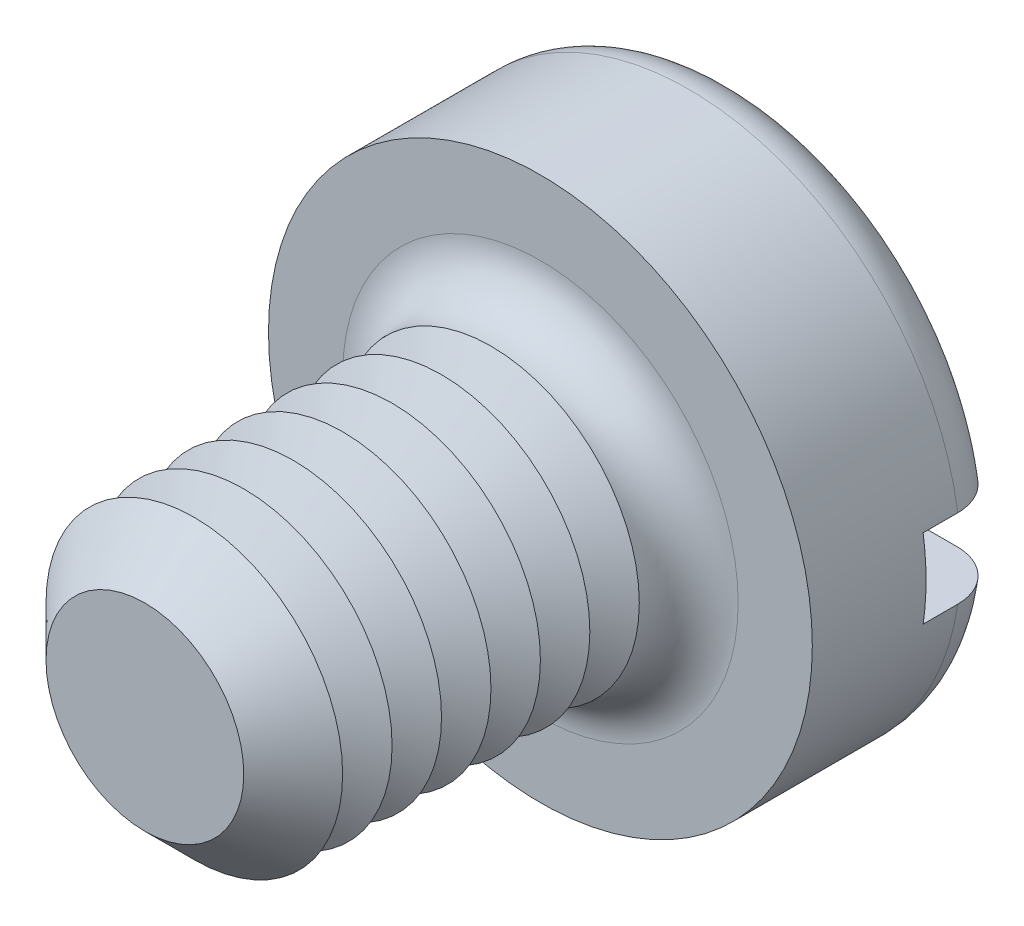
ISO-10303-21;
HEADER;
FILE_DESCRIPTION(('STEP AP214'),'2;1');
FILE_NAME('part.step','',(''),(''),'','','');
FILE_SCHEMA(('AUTOMOTIVE_DESIGN { 1 0 10303 214 1 1 1 1 }'));
ENDSEC;
DATA;
#1=APPLICATION_CONTEXT('core data for automotive mechanical design processes');
#2=APPLICATION_PROTOCOL_DEFINITION('international standard','automotive_design',2000,#1);
#3=PRODUCT_CONTEXT('',#1,'mechanical');
#4=PRODUCT('Part','Part','',(#3));
#5=PRODUCT_RELATED_PRODUCT_CATEGORY('part','',(#4));
#6=PRODUCT_DEFINITION_FORMATION('','',#4);
#7=PRODUCT_DEFINITION_CONTEXT('part definition',#1,'design');
#8=PRODUCT_DEFINITION('design','',#6,#7);
#9=PRODUCT_DEFINITION_SHAPE('','',#8);
#10=(LENGTH_UNIT() NAMED_UNIT(*) SI_UNIT(.MILLI.,.METRE.));
#11=(NAMED_UNIT(*) PLANE_ANGLE_UNIT() SI_UNIT($,.RADIAN.));
#12=(NAMED_UNIT(*) SI_UNIT($,.STERADIAN.) SOLID_ANGLE_UNIT());
#13=UNCERTAINTY_MEASURE_WITH_UNIT(LENGTH_MEASURE(1.E-05),#10,'distance_accuracy_value','');
#14=(GEOMETRIC_REPRESENTATION_CONTEXT(3) GLOBAL_UNCERTAINTY_ASSIGNED_CONTEXT((#13)) GLOBAL_UNIT_ASSIGNED_CONTEXT((#10,
#11,#12)) REPRESENTATION_CONTEXT('',''));
#15=CARTESIAN_POINT('',(0.,0.,0.));
#16=DIRECTION('',(0.,0.,1.));
#17=DIRECTION('',(1.,0.,0.));
#18=AXIS2_PLACEMENT_3D('',#15,#16,#17);
#19=CARTESIAN_POINT('',(0.,0.,-2.));
#20=DIRECTION('',(0.,0.,1.));
#21=DIRECTION('',(1.,0.,0.));
#22=AXIS2_PLACEMENT_3D('',#19,#20,#21);
#23=PLANE('',#22);
#24=CARTESIAN_POINT('',(0.,0.,-2.));
#25=DIRECTION('',(0.,0.,1.));
#26=DIRECTION('',(1.,0.,0.));
#27=AXIS2_PLACEMENT_3D('',#24,#25,#26);
#28=CIRCLE('',#27,2.25);
#29=CARTESIAN_POINT('',(-2.21415898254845,0.4,-2.));
#30=VERTEX_POINT('',#29);
#31=CARTESIAN_POINT('',(2.21415898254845,0.4,-2.));
#32=VERTEX_POINT('',#31);
#33=EDGE_CURVE('E116',#30,#32,#28,.F.);
#34=ORIENTED_EDGE('',*,*,#33,.T.);
#35=DIRECTION('',(1.,0.,0.));
#36=VECTOR('',#35,1.);
#37=CARTESIAN_POINT('',(-2.75,0.400000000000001,-2.));
#38=LINE('',#37,#36);
#39=EDGE_CURVE('E111',#30,#32,#38,.T.);
#40=ORIENTED_EDGE('',*,*,#39,.F.);
#41=EDGE_LOOP('',(#34,#40));
#42=FACE_BOUND('',#41,.T.);
#43=ADVANCED_FACE('F39',(#42),#23,.F.);
#44=CARTESIAN_POINT('',(0.,0.,-1.5));
#45=DIRECTION('',(0.,0.,1.));
#46=DIRECTION('',(1.,0.,0.));
#47=AXIS2_PLACEMENT_3D('',#44,#45,#46);
#48=TOROIDAL_SURFACE('',#47,2.25,0.5);
#49=CARTESIAN_POINT('',(-2.6296588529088,0.400000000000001,-1.78631483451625));
#50=CARTESIAN_POINT('',(-2.61332846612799,0.400000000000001,-1.80942627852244));
#51=CARTESIAN_POINT('',(-2.59501593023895,0.400000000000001,-1.83116426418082));
#52=CARTESIAN_POINT('',(-2.55497423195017,0.400000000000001,-1.87126271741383));
#53=CARTESIAN_POINT('',(-2.53324055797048,0.4,-1.88961865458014));
#54=CARTESIAN_POINT('',(-2.48702796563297,0.4,-1.92241505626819));
#55=CARTESIAN_POINT('',(-2.46255183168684,0.4,-1.93685944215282));
#56=CARTESIAN_POINT('',(-2.41154731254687,0.4,-1.96147315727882));
#57=CARTESIAN_POINT('',(-2.38501943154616,0.4,-1.97164353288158));
#58=CARTESIAN_POINT('',(-2.3303912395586,0.4,-1.98753780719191));
#59=CARTESIAN_POINT('',(-2.30227842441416,0.4,-1.99321871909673));
#60=CARTESIAN_POINT('',(-2.24549884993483,0.4,-1.99984170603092));
#61=CARTESIAN_POINT('',(-2.21683202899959,0.4,-2.00078325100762));
#62=CARTESIAN_POINT('',(-2.15939326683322,0.4,-1.99790249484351));
#63=CARTESIAN_POINT('',(-2.13062419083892,0.4,-1.99402290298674));
#64=CARTESIAN_POINT('',(-2.07413526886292,0.4,-1.98151915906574));
#65=CARTESIAN_POINT('',(-2.04641547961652,0.4,-1.97289475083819));
#66=CARTESIAN_POINT('',(-1.99264697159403,0.4,-1.95107177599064));
#67=CARTESIAN_POINT('',(-1.96660904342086,0.4,-1.93784659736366));
#68=CARTESIAN_POINT('',(-1.91713954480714,0.4,-1.90718730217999));
#69=CARTESIAN_POINT('',(-1.89370795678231,0.4,-1.88975321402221));
#70=CARTESIAN_POINT('',(-1.85029144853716,0.4,-1.85126548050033));
#71=CARTESIAN_POINT('',(-1.83028607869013,0.4,-1.83023492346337));
#72=CARTESIAN_POINT('',(-1.79417432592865,0.4,-1.78505552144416));
#73=CARTESIAN_POINT('',(-1.77806752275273,0.4,-1.76090701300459));
#74=CARTESIAN_POINT('',(-1.75056079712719,0.4,-1.71067721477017));
#75=CARTESIAN_POINT('',(-1.7390748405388,0.4,-1.68464306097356));
#76=CARTESIAN_POINT('',(-1.72075680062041,0.4,-1.63098625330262));
#77=CARTESIAN_POINT('',(-1.71392397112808,0.4,-1.60336385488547));
#78=CARTESIAN_POINT('',(-1.70525661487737,0.4,-1.54801066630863));
#79=CARTESIAN_POINT('',(-1.70330866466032,0.4,-1.52029759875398));
#80=CARTESIAN_POINT('',(-1.70414820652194,0.4,-1.46494458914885));
#81=CARTESIAN_POINT('',(-1.70693532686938,0.4,-1.43730464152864));
#82=CARTESIAN_POINT('',(-1.71709335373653,0.4,-1.38318389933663));
#83=CARTESIAN_POINT('',(-1.72441580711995,0.4,-1.35669397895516));
#84=CARTESIAN_POINT('',(-1.74335830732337,0.4,-1.30529964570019));
#85=CARTESIAN_POINT('',(-1.75497853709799,0.4,-1.2803953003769));
#86=CARTESIAN_POINT('',(-1.78229453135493,0.4,-1.23258298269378));
#87=CARTESIAN_POINT('',(-1.79803217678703,0.4,-1.20969896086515));
#88=CARTESIAN_POINT('',(-1.83304498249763,0.4,-1.16682064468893));
#89=CARTESIAN_POINT('',(-1.85232054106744,0.4,-1.1468266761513));
#90=CARTESIAN_POINT('',(-1.89433695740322,0.4,-1.10980713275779));
#91=CARTESIAN_POINT('',(-1.91714740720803,0.4,-1.09286053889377));
#92=CARTESIAN_POINT('',(-1.96524407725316,0.4,-1.06294809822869));
#93=CARTESIAN_POINT('',(-1.99053056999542,0.4,-1.04998269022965));
#94=CARTESIAN_POINT('',(-2.04340612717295,0.4,-1.02814800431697));
#95=CARTESIAN_POINT('',(-2.07103098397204,0.4,-1.01936532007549));
#96=CARTESIAN_POINT('',(-2.12735840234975,0.4,-1.00652373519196));
#97=CARTESIAN_POINT('',(-2.15606102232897,0.4,-1.00246509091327));
#98=CARTESIAN_POINT('',(-2.21395379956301,0.4,-0.999181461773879));
#99=CARTESIAN_POINT('',(-2.24314598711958,0.4,-0.999992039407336));
#100=CARTESIAN_POINT('',(-2.30097585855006,0.4,-1.00652779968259));
#101=CARTESIAN_POINT('',(-2.32961355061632,0.4,-1.01225290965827));
#102=CARTESIAN_POINT('',(-2.38536238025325,0.4,-1.02843951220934));
#103=CARTESIAN_POINT('',(-2.41248047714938,0.4,-1.03887701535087));
#104=CARTESIAN_POINT('',(-2.46454860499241,0.4,-1.06421009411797));
#105=CARTESIAN_POINT('',(-2.48949875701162,0.4,-1.0791054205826));
#106=CARTESIAN_POINT('',(-2.53620471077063,0.4,-1.11274531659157));
#107=CARTESIAN_POINT('',(-2.55799482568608,0.400000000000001,-1.1314422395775));
#108=CARTESIAN_POINT('',(-2.59807595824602,0.400000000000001,-1.17227176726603));
#109=CARTESIAN_POINT('',(-2.6163672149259,0.400000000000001,-1.19440413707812));
#110=CARTESIAN_POINT('',(-2.64868581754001,0.400000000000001,-1.24117072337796));
#111=CARTESIAN_POINT('',(-2.66276466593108,0.400000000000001,-1.26576935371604));
#112=CARTESIAN_POINT('',(-2.68654482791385,0.400000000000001,-1.31699754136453));
#113=CARTESIAN_POINT('',(-2.69624657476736,0.400000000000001,-1.34362689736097));
#114=CARTESIAN_POINT('',(-2.71090527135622,0.400000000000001,-1.39787706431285));
#115=CARTESIAN_POINT('',(-2.71590826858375,0.400000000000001,-1.4254854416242));
#116=CARTESIAN_POINT('',(-2.72118463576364,0.400000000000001,-1.48115803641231));
#117=CARTESIAN_POINT('',(-2.72145696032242,0.400000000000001,-1.50922235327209));
#118=CARTESIAN_POINT('',(-2.71727180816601,0.400000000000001,-1.56487271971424));
#119=CARTESIAN_POINT('',(-2.71283440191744,0.400000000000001,-1.59246029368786));
#120=CARTESIAN_POINT('',(-2.69939521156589,0.400000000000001,-1.64647499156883));
#121=CARTESIAN_POINT('',(-2.69039909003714,0.400000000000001,-1.67290351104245));
#122=CARTESIAN_POINT('',(-2.67251693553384,0.400000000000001,-1.71382731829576));
#123=CARTESIAN_POINT('',(-2.66497994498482,0.400000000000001,-1.72892686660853));
#124=CARTESIAN_POINT('',(-2.64841616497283,0.400000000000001,-1.75828509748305));
#125=CARTESIAN_POINT('',(-2.63938938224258,0.400000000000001,-1.77254378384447));
#126=CARTESIAN_POINT('',(-2.6296588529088,0.400000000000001,-1.78631483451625));
#127=B_SPLINE_CURVE_WITH_KNOTS('',3,(#49,#50,#51,#52,#53,#54,#55,#56,#57,#58,#59,#60,#61,#62,
#63,#64,#65,#66,#67,#68,#69,#70,#71,#72,#73,#74,#75,#76,#77,#78,#79,#80,#81,#82,#83,#84,#85,#86,
#87,#88,#89,#90,#91,#92,#93,#94,#95,#96,#97,#98,#99,#100,#101,#102,#103,#104,#105,#106,#107,
#108,#109,#110,#111,#112,#113,#114,#115,#116,#117,#118,#119,#120,#121,#122,#123,#124,#125,#126),
.UNSPECIFIED.,.T.,.F.,(4,2,2,2,2,2,2,2,2,2,2,2,2,2,2,2,2,2,2,2,2,2,2,2,2,2,2,2,2,2,2,2,2,2,2,2,
2,2,4),(0.,0.0848338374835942,0.16978050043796,0.254641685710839,0.339482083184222,
0.42512530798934,0.510778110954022,0.597458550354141,0.684143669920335,0.771338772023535,
0.858533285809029,0.945187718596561,1.03183280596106,1.11678035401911,1.20171427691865,
1.28465703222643,1.36759327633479,1.4496584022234,1.53172702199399,1.61466526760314,
1.69761285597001,1.78247103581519,1.86733856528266,1.95389396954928,2.0404540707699,
2.12764713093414,2.21483890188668,2.30159172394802,2.38833969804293,2.4740609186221,
2.55977628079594,2.6443962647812,2.72900787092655,2.81278135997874,2.89657336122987,
2.98000971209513,3.06334267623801,3.113891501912,3.16444009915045),.UNSPECIFIED.);
#128=CARTESIAN_POINT('',(-2.72075357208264,0.400000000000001,-1.50000000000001));
#129=VERTEX_POINT('',#128);
#130=EDGE_CURVE('E226',#129,#30,#127,.T.);
#131=ORIENTED_EDGE('',*,*,#130,.F.);
#132=CARTESIAN_POINT('',(0.,0.,-1.5));
#133=DIRECTION('',(0.,0.,1.));
#134=DIRECTION('',(1.,0.,0.));
#135=AXIS2_PLACEMENT_3D('',#132,#133,#134);
#136=CIRCLE('',#135,2.75);
#137=CARTESIAN_POINT('',(2.7207535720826,0.4,-1.5));
#138=VERTEX_POINT('',#137);
#139=EDGE_CURVE('E124',#138,#129,#136,.T.);
#140=ORIENTED_EDGE('',*,*,#139,.F.);
#141=CARTESIAN_POINT('',(1.7362507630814,0.4,-1.6752840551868));
#142=CARTESIAN_POINT('',(1.74636083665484,0.4,-1.70159961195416));
#143=CARTESIAN_POINT('',(1.7587429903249,0.4,-1.72706707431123));
#144=CARTESIAN_POINT('',(1.78764414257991,0.4,-1.77556609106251));
#145=CARTESIAN_POINT('',(1.80416918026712,0.4,-1.79859401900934));
#146=CARTESIAN_POINT('',(1.84080454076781,0.4,-1.84153587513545));
#147=CARTESIAN_POINT('',(1.86090949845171,0.4,-1.86145438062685));
#148=CARTESIAN_POINT('',(1.9041208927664,0.4,-1.89769607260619));
#149=CARTESIAN_POINT('',(1.92722659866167,0.4,-1.91402013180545));
#150=CARTESIAN_POINT('',(1.97620958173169,0.4,-1.94291288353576));
#151=CARTESIAN_POINT('',(2.00212726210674,0.4,-1.95541309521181));
#152=CARTESIAN_POINT('',(2.05567603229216,0.4,-1.97595143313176));
#153=CARTESIAN_POINT('',(2.08330733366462,0.4,-1.98398900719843));
#154=CARTESIAN_POINT('',(2.13989163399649,0.4,-1.99545904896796));
#155=CARTESIAN_POINT('',(2.16885726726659,0.4,-1.99882930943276));
#156=CARTESIAN_POINT('',(2.22694412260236,0.4,-2.00065872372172));
#157=CARTESIAN_POINT('',(2.25606534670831,0.4,-1.99911781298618));
#158=CARTESIAN_POINT('',(2.31362436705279,0.4,-1.99114818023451));
#159=CARTESIAN_POINT('',(2.34206235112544,0.4,-1.98472081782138));
#160=CARTESIAN_POINT('',(2.39743709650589,0.4,-1.96713601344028));
#161=CARTESIAN_POINT('',(2.42437392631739,0.4,-1.95597878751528));
#162=CARTESIAN_POINT('',(2.47569769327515,0.4,-1.92935960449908));
#163=CARTESIAN_POINT('',(2.50010686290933,0.4,-1.91394052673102));
#164=CARTESIAN_POINT('',(2.54594525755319,0.4,-1.8791725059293));
#165=CARTESIAN_POINT('',(2.56737468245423,0.4,-1.85982382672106));
#166=CARTESIAN_POINT('',(2.60634898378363,0.4,-1.81801641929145));
#167=CARTESIAN_POINT('',(2.6239407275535,0.4,-1.79560138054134));
#168=CARTESIAN_POINT('',(2.65505953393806,0.4,-1.7481077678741));
#169=CARTESIAN_POINT('',(2.66858686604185,0.4,-1.72302937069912));
#170=CARTESIAN_POINT('',(2.69103536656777,0.4,-1.67123055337));
#171=CARTESIAN_POINT('',(2.70000740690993,0.4,-1.64453217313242));
#172=CARTESIAN_POINT('',(2.71330608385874,0.4,-1.59000262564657));
#173=CARTESIAN_POINT('',(2.71763293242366,0.4,-1.5621715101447));
#174=CARTESIAN_POINT('',(2.72149675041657,0.4,-1.50637655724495));
#175=CARTESIAN_POINT('',(2.72106725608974,0.4,-1.47841503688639));
#176=CARTESIAN_POINT('',(2.7155123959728,0.4,-1.42296287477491));
#177=CARTESIAN_POINT('',(2.71038711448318,0.4,-1.39547222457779));
#178=CARTESIAN_POINT('',(2.69560462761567,0.4,-1.34178071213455));
#179=CARTESIAN_POINT('',(2.68595389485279,0.4,-1.31557806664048));
#180=CARTESIAN_POINT('',(2.66240876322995,0.4,-1.26515516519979));
#181=CARTESIAN_POINT('',(2.64851431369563,0.4,-1.24093493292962));
#182=CARTESIAN_POINT('',(2.61681930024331,0.4,-1.19504594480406));
#183=CARTESIAN_POINT('',(2.59900198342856,0.4,-1.17338876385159));
#184=CARTESIAN_POINT('',(2.56001495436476,0.4,-1.13333899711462));
#185=CARTESIAN_POINT('',(2.53884510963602,0.4,-1.11494654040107));
#186=CARTESIAN_POINT('',(2.49354554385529,0.4,-1.08175888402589));
#187=CARTESIAN_POINT('',(2.46938991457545,0.4,-1.06699905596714));
#188=CARTESIAN_POINT('',(2.41896725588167,0.4,-1.04168682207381));
#189=CARTESIAN_POINT('',(2.39270009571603,0.4,-1.03113467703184));
#190=CARTESIAN_POINT('',(2.33844927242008,0.4,-1.01439607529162));
#191=CARTESIAN_POINT('',(2.31044823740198,0.4,-1.00826592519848));
#192=CARTESIAN_POINT('',(2.25381752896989,0.4,-1.00073183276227));
#193=CARTESIAN_POINT('',(2.22518781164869,0.4,-0.999328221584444));
#194=CARTESIAN_POINT('',(2.16774231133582,0.4,-1.00127811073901));
#195=CARTESIAN_POINT('',(2.13892848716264,0.4,-1.00468955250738));
#196=CARTESIAN_POINT('',(2.08227193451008,0.4,-1.01626887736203));
#197=CARTESIAN_POINT('',(2.05442926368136,0.4,-1.02443704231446));
#198=CARTESIAN_POINT('',(2.00032604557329,0.4,-1.04537295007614));
#199=CARTESIAN_POINT('',(1.97407661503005,0.4,-1.05816944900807));
#200=CARTESIAN_POINT('',(1.92411255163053,0.4,-1.08801035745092));
#201=CARTESIAN_POINT('',(1.90039792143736,0.4,-1.10505477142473));
#202=CARTESIAN_POINT('',(1.85633574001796,0.4,-1.14282887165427));
#203=CARTESIAN_POINT('',(1.83597040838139,0.4,-1.16353779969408));
#204=CARTESIAN_POINT('',(1.79908731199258,0.4,-1.20813793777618));
#205=CARTESIAN_POINT('',(1.78256899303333,0.4,-1.23202868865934));
#206=CARTESIAN_POINT('',(1.75420022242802,0.4,-1.28183173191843));
#207=CARTESIAN_POINT('',(1.74226635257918,0.4,-1.30769648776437));
#208=CARTESIAN_POINT('',(1.72302798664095,0.4,-1.36110211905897));
#209=CARTESIAN_POINT('',(1.71572395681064,0.4,-1.38864316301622));
#210=CARTESIAN_POINT('',(1.70611974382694,0.4,-1.44392326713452));
#211=CARTESIAN_POINT('',(1.70370764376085,0.4,-1.47164298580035));
#212=CARTESIAN_POINT('',(1.70363822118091,0.4,-1.52706336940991));
#213=CARTESIAN_POINT('',(1.70597448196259,0.4,-1.55476400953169));
#214=CARTESIAN_POINT('',(1.71335146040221,0.4,-1.59796127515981));
#215=CARTESIAN_POINT('',(1.71686033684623,0.4,-1.61373520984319));
#216=CARTESIAN_POINT('',(1.7254146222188,0.4,-1.64486018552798));
#217=CARTESIAN_POINT('',(1.73045999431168,0.4,-1.66021123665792));
#218=CARTESIAN_POINT('',(1.7362507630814,0.4,-1.6752840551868));
#219=B_SPLINE_CURVE_WITH_KNOTS('',3,(#141,#142,#143,#144,#145,#146,#147,#148,#149,#150,#151,
#152,#153,#154,#155,#156,#157,#158,#159,#160,#161,#162,#163,#164,#165,#166,#167,#168,#169,#170,
#171,#172,#173,#174,#175,#176,#177,#178,#179,#180,#181,#182,#183,#184,#185,#186,#187,#188,#189,
#190,#191,#192,#193,#194,#195,#196,#197,#198,#199,#200,#201,#202,#203,#204,#205,#206,#207,#208,
#209,#210,#211,#212,#213,#214,#215,#216,#217,#218),.UNSPECIFIED.,.T.,.F.,(4,2,2,2,2,2,2,2,2,2,2,
2,2,2,2,2,2,2,2,2,2,2,2,2,2,2,2,2,2,2,2,2,2,2,2,2,2,2,4),(0.,0.0845117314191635,
0.169147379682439,0.253657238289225,0.338146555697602,0.424070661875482,0.510005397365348,
0.597074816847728,0.684145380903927,0.771191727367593,0.858234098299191,0.94443074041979,
1.03062159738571,1.11569223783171,1.20075723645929,1.28485012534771,1.36893917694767,
1.45243570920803,1.53593074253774,1.61930671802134,1.70268368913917,1.7864238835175,
1.87016738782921,1.95469664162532,2.03923113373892,2.12482389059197,2.21042264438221,
2.29706026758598,2.38370302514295,2.47089361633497,2.55808429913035,2.64479602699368,
2.73149525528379,2.81653234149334,2.9015779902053,2.98465497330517,3.06761976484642,
3.11602689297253,3.164432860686),.UNSPECIFIED.);
#220=EDGE_CURVE('E228',#32,#138,#219,.T.);
#221=ORIENTED_EDGE('',*,*,#220,.F.);
#222=ORIENTED_EDGE('',*,*,#33,.F.);
#223=EDGE_LOOP('',(#131,#140,#221,#222));
#224=FACE_BOUND('',#223,.T.);
#225=ADVANCED_FACE('F210',(#224),#48,.T.);
#226=CARTESIAN_POINT('',(0.,0.,-2.));
#227=DIRECTION('',(0.,0.,1.));
#228=DIRECTION('',(1.,0.,0.));
#229=AXIS2_PLACEMENT_3D('',#226,#227,#228);
#230=CYLINDRICAL_SURFACE('',#229,2.75);
#231=DIRECTION('',(0.,0.,1.));
#232=VECTOR('',#231,1.);
#233=CARTESIAN_POINT('',(2.72075357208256,0.4,-2.));
#234=LINE('',#233,#232);
#235=CARTESIAN_POINT('',(2.72075357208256,0.4,-1.15));
#236=VERTEX_POINT('',#235);
#237=EDGE_CURVE('E241',#138,#236,#234,.T.);
#238=ORIENTED_EDGE('',*,*,#237,.F.);
#239=ORIENTED_EDGE('',*,*,#139,.T.);
#240=DIRECTION('',(0.,0.,1.));
#241=VECTOR('',#240,1.);
#242=CARTESIAN_POINT('',(-2.72075357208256,0.4,-2.));
#243=LINE('',#242,#241);
#244=CARTESIAN_POINT('',(-2.72075357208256,0.4,-1.15));
#245=VERTEX_POINT('',#244);
#246=EDGE_CURVE('E63',#245,#129,#243,.F.);
#247=ORIENTED_EDGE('',*,*,#246,.F.);
#248=CARTESIAN_POINT('',(0.,0.,-1.15));
#249=DIRECTION('',(0.,0.,-1.));
#250=DIRECTION('',(-1.,0.,0.));
#251=AXIS2_PLACEMENT_3D('',#248,#249,#250);
#252=CIRCLE('',#251,2.75);
#253=CARTESIAN_POINT('',(-2.72075357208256,-0.4,-1.15));
#254=VERTEX_POINT('',#253);
#255=EDGE_CURVE('E43',#245,#254,#252,.F.);
#256=ORIENTED_EDGE('',*,*,#255,.T.);
#257=DIRECTION('',(0.,0.,1.));
#258=VECTOR('',#257,1.);
#259=CARTESIAN_POINT('',(-2.72075357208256,-0.4,-2.));
#260=LINE('',#259,#258);
#261=CARTESIAN_POINT('',(-2.72075357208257,-0.4,-1.5));
#262=VERTEX_POINT('',#261);
#263=EDGE_CURVE('E238',#262,#254,#260,.T.);
#264=ORIENTED_EDGE('',*,*,#263,.F.);
#265=CARTESIAN_POINT('',(2.72075357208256,-0.4,-1.5));
#266=VERTEX_POINT('',#265);
#267=EDGE_CURVE('E126',#262,#266,#136,.T.);
#268=ORIENTED_EDGE('',*,*,#267,.T.);
#269=DIRECTION('',(0.,0.,1.));
#270=VECTOR('',#269,1.);
#271=CARTESIAN_POINT('',(2.72075357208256,-0.4,-2.));
#272=LINE('',#271,#270);
#273=CARTESIAN_POINT('',(2.72075357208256,-0.4,-1.15));
#274=VERTEX_POINT('',#273);
#275=EDGE_CURVE('E55',#274,#266,#272,.F.);
#276=ORIENTED_EDGE('',*,*,#275,.F.);
#277=EDGE_CURVE('E11',#274,#236,#252,.F.);
#278=ORIENTED_EDGE('',*,*,#277,.T.);
#279=EDGE_LOOP('',(#238,#239,#247,#256,#264,#268,#276,#278));
#280=FACE_BOUND('',#279,.T.);
#281=CARTESIAN_POINT('',(0.,0.,0.));
#282=DIRECTION('',(0.,0.,1.));
#283=DIRECTION('',(1.,0.,0.));
#284=AXIS2_PLACEMENT_3D('',#281,#282,#283);
#285=CIRCLE('',#284,2.75);
#286=CARTESIAN_POINT('',(2.75,0.,0.));
#287=VERTEX_POINT('',#286);
#288=EDGE_CURVE('E244',#287,#287,#285,.T.);
#289=ORIENTED_EDGE('',*,*,#288,.F.);
#290=EDGE_LOOP('',(#289));
#291=FACE_BOUND('',#290,.T.);
#292=ADVANCED_FACE('F206',(#280,#291),#230,.T.);
#293=CARTESIAN_POINT('',(2.21415898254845,-0.4,-2.));
#294=VERTEX_POINT('',#293);
#295=CARTESIAN_POINT('',(-2.21415898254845,-0.4,-2.));
#296=VERTEX_POINT('',#295);
#297=EDGE_CURVE('E109',#294,#296,#28,.F.);
#298=ORIENTED_EDGE('',*,*,#297,.T.);
#299=DIRECTION('',(-1.,0.,0.));
#300=VECTOR('',#299,1.);
#301=CARTESIAN_POINT('',(-2.75,-0.4,-2.));
#302=LINE('',#301,#300);
#303=EDGE_CURVE('E96',#294,#296,#302,.T.);
#304=ORIENTED_EDGE('',*,*,#303,.F.);
#305=EDGE_LOOP('',(#298,#304));
#306=FACE_BOUND('',#305,.T.);
#307=ADVANCED_FACE('F108',(#306),#23,.F.);
#308=CARTESIAN_POINT('',(0.,0.,0.));
#309=DIRECTION('',(0.,0.,1.));
#310=DIRECTION('',(1.,0.,0.));
#311=AXIS2_PLACEMENT_3D('',#308,#309,#310);
#312=PLANE('',#311);
#313=CARTESIAN_POINT('',(0.,0.,0.));
#314=DIRECTION('',(0.,0.,1.));
#315=DIRECTION('',(1.,0.,0.));
#316=AXIS2_PLACEMENT_3D('',#313,#314,#315);
#317=CIRCLE('',#316,2.);
#318=CARTESIAN_POINT('',(2.,0.,0.));
#319=VERTEX_POINT('',#318);
#320=EDGE_CURVE('E115',#319,#319,#317,.F.);
#321=ORIENTED_EDGE('',*,*,#320,.T.);
#322=EDGE_LOOP('',(#321));
#323=FACE_BOUND('',#322,.T.);
#324=ORIENTED_EDGE('',*,*,#288,.T.);
#325=EDGE_LOOP('',(#324));
#326=FACE_BOUND('',#325,.T.);
#327=ADVANCED_FACE('F205',(#323,#326),#312,.T.);
#328=CARTESIAN_POINT('',(-2.6296588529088,-0.4,-1.78631483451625));
#329=CARTESIAN_POINT('',(-2.64575286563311,-0.4,-1.76353353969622));
#330=CARTESIAN_POINT('',(-2.65994473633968,-0.4,-1.73938506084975));
#331=CARTESIAN_POINT('',(-2.68408879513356,-0.4,-1.68903091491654));
#332=CARTESIAN_POINT('',(-2.69403633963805,-0.4,-1.6628230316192));
#333=CARTESIAN_POINT('',(-2.70937899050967,-0.4,-1.60911025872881));
#334=CARTESIAN_POINT('',(-2.71477511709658,-0.4,-1.5816056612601));
#335=CARTESIAN_POINT('',(-2.72085365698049,-0.4,-1.52608718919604));
#336=CARTESIAN_POINT('',(-2.7215371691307,-0.4,-1.49807343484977));
#337=CARTESIAN_POINT('',(-2.71817903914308,-0.4,-1.44242333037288));
#338=CARTESIAN_POINT('',(-2.71415291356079,-0.4,-1.41478604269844));
#339=CARTESIAN_POINT('',(-2.70152104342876,-0.4,-1.36057835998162));
#340=CARTESIAN_POINT('',(-2.69291517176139,-0.4,-1.33400799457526));
#341=CARTESIAN_POINT('',(-2.67137052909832,-0.4,-1.28266198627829));
#342=CARTESIAN_POINT('',(-2.65842829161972,-0.4,-1.25788779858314));
#343=CARTESIAN_POINT('',(-2.62859348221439,-0.4,-1.21084577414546));
#344=CARTESIAN_POINT('',(-2.61170082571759,-0.4,-1.18857799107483));
#345=CARTESIAN_POINT('',(-2.5743351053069,-0.4,-1.1470221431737));
#346=CARTESIAN_POINT('',(-2.55383974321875,-0.4,-1.12775413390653));
#347=CARTESIAN_POINT('',(-2.5099353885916,-0.4,-1.09288845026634));
#348=CARTESIAN_POINT('',(-2.48652625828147,-0.4,-1.07729094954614));
#349=CARTESIAN_POINT('',(-2.43718903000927,-0.4,-1.0500239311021));
#350=CARTESIAN_POINT('',(-2.41123629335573,-0.4,-1.0383990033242));
#351=CARTESIAN_POINT('',(-2.35776417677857,-0.4,-1.01960886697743));
#352=CARTESIAN_POINT('',(-2.33024469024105,-0.4,-1.01244396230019));
#353=CARTESIAN_POINT('',(-2.27404134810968,-0.4,-1.00268156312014));
#354=CARTESIAN_POINT('',(-2.24534705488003,-0.4,-1.00014414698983));
#355=CARTESIAN_POINT('',(-2.18793513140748,-0.4,-0.999867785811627));
#356=CARTESIAN_POINT('',(-2.15921749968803,-0.4,-1.00212917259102));
#357=CARTESIAN_POINT('',(-2.10225052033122,-0.4,-1.01142552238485));
#358=CARTESIAN_POINT('',(-2.07400941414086,-0.4,-1.01851105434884));
#359=CARTESIAN_POINT('',(-2.01911044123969,-0.4,-1.03730994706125));
#360=CARTESIAN_POINT('',(-1.99245264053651,-0.4,-1.04902350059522));
#361=CARTESIAN_POINT('',(-1.94142108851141,-0.4,-1.07679847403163));
#362=CARTESIAN_POINT('',(-1.91705303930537,-0.4,-1.09287038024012));
#363=CARTESIAN_POINT('',(-1.87139758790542,-0.4,-1.12891897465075));
#364=CARTESIAN_POINT('',(-1.85011007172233,-0.4,-1.14889551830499));
#365=CARTESIAN_POINT('',(-1.81149058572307,-0.4,-1.19196940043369));
#366=CARTESIAN_POINT('',(-1.79411779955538,-0.4,-1.21503011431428));
#367=CARTESIAN_POINT('',(-1.76359546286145,-0.4,-1.26379588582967));
#368=CARTESIAN_POINT('',(-1.75044532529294,-0.4,-1.28950057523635));
#369=CARTESIAN_POINT('',(-1.72906221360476,-0.4,-1.3422057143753));
#370=CARTESIAN_POINT('',(-1.72072512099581,-0.4,-1.3691639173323));
#371=CARTESIAN_POINT('',(-1.70880448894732,-0.4,-1.42411084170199));
#372=CARTESIAN_POINT('',(-1.7052202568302,-0.4,-1.45209941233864));
#373=CARTESIAN_POINT('',(-1.70295553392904,-0.4,-1.50768522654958));
#374=CARTESIAN_POINT('',(-1.70417398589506,-0.4,-1.53527840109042));
#375=CARTESIAN_POINT('',(-1.71124536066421,-0.4,-1.58986292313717));
#376=CARTESIAN_POINT('',(-1.71709811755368,-0.4,-1.61685429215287));
#377=CARTESIAN_POINT('',(-1.73321132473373,-0.4,-1.66938107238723));
#378=CARTESIAN_POINT('',(-1.74345625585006,-0.4,-1.69492125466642));
#379=CARTESIAN_POINT('',(-1.76802111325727,-0.4,-1.74395877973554));
#380=CARTESIAN_POINT('',(-1.78234133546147,-0.4,-1.76745597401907));
#381=CARTESIAN_POINT('',(-1.81488631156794,-0.4,-1.81216193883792));
#382=CARTESIAN_POINT('',(-1.83317116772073,-0.4,-1.83332693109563));
#383=CARTESIAN_POINT('',(-1.87296030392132,-0.4,-1.872375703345));
#384=CARTESIAN_POINT('',(-1.89446497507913,-0.4,-1.89025908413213));
#385=CARTESIAN_POINT('',(-1.94063077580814,-0.4,-1.92267732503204));
#386=CARTESIAN_POINT('',(-1.96535444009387,-0.4,-1.93712316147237));
#387=CARTESIAN_POINT('',(-2.01684705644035,-0.4,-1.96173690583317));
#388=CARTESIAN_POINT('',(-2.04361620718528,-0.4,-1.97190439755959));
#389=CARTESIAN_POINT('',(-2.09891021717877,-0.4,-1.9878230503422));
#390=CARTESIAN_POINT('',(-2.12745653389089,-0.4,-1.99349978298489));
#391=CARTESIAN_POINT('',(-2.18509639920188,-0.4,-1.99999556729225));
#392=CARTESIAN_POINT('',(-2.21418994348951,-0.4,-2.00081465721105));
#393=CARTESIAN_POINT('',(-2.27218032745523,-0.4,-1.99755156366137));
#394=CARTESIAN_POINT('',(-2.30107643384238,-0.4,-1.99345627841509));
#395=CARTESIAN_POINT('',(-2.35776697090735,-0.4,-1.98043125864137));
#396=CARTESIAN_POINT('',(-2.38556116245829,-0.4,-1.97150048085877));
#397=CARTESIAN_POINT('',(-2.43901832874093,-0.4,-1.94912081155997));
#398=CARTESIAN_POINT('',(-2.46469578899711,-0.4,-1.93570648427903));
#399=CARTESIAN_POINT('',(-2.51337022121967,-0.4,-1.90471183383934));
#400=CARTESIAN_POINT('',(-2.53637056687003,-0.4,-1.88713684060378));
#401=CARTESIAN_POINT('',(-2.57111030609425,-0.4,-1.85552084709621));
#402=CARTESIAN_POINT('',(-2.58386709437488,-0.4,-1.84257896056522));
#403=CARTESIAN_POINT('',(-2.60790410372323,-0.4,-1.81538935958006));
#404=CARTESIAN_POINT('',(-2.61918433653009,-0.4,-1.80114165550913));
#405=CARTESIAN_POINT('',(-2.6296588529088,-0.4,-1.78631483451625));
#406=B_SPLINE_CURVE_WITH_KNOTS('',3,(#328,#329,#330,#331,#332,#333,#334,#335,#336,#337,#338,
#339,#340,#341,#342,#343,#344,#345,#346,#347,#348,#349,#350,#351,#352,#353,#354,#355,#356,#357,
#358,#359,#360,#361,#362,#363,#364,#365,#366,#367,#368,#369,#370,#371,#372,#373,#374,#375,#376,
#377,#378,#379,#380,#381,#382,#383,#384,#385,#386,#387,#388,#389,#390,#391,#392,#393,#394,#395,
#396,#397,#398,#399,#400,#401,#402,#403,#404,#405),.UNSPECIFIED.,.T.,.F.,(4,2,2,2,2,2,2,2,2,2,2,
2,2,2,2,2,2,2,2,2,2,2,2,2,2,2,2,2,2,2,2,2,2,2,2,2,2,2,4),(0.,0.0836125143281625,
0.167316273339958,0.251001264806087,0.334666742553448,0.418057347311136,0.501450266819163,
0.584910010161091,0.668371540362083,0.752369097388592,0.836370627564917,0.921286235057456,
1.00620762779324,1.09222390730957,1.17824613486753,1.26518425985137,1.35212600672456,
1.43927882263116,1.52642841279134,1.61262232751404,1.69880425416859,1.7830443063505,
1.86727208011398,1.9497371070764,2.03219918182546,2.1143722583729,2.19655130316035,
2.28007615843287,2.36361116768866,2.44911836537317,2.53463387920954,2.62153862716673,
2.70844269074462,2.79557895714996,2.88273403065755,2.96923214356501,3.05562004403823,
3.11003826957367,3.16445606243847),.UNSPECIFIED.);
#407=EDGE_CURVE('E103',#296,#262,#406,.T.);
#408=ORIENTED_EDGE('',*,*,#407,.F.);
#409=ORIENTED_EDGE('',*,*,#297,.F.);
#410=CARTESIAN_POINT('',(1.7362507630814,-0.4,-1.6752840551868));
#411=CARTESIAN_POINT('',(1.72641416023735,-0.4,-1.64967314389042));
#412=CARTESIAN_POINT('',(1.71871480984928,-0.4,-1.62322216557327));
#413=CARTESIAN_POINT('',(1.70786038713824,-0.4,-1.56938399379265));
#414=CARTESIAN_POINT('',(1.70470970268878,-0.4,-1.54199592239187));
#415=CARTESIAN_POINT('',(1.70306971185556,-0.4,-1.48708393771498));
#416=CARTESIAN_POINT('',(1.70457942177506,-0.4,-1.45956005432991));
#417=CARTESIAN_POINT('',(1.71220670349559,-0.4,-1.40516538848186));
#418=CARTESIAN_POINT('',(1.71832341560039,-0.4,-1.3782944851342));
#419=CARTESIAN_POINT('',(1.73494792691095,-0.4,-1.32598312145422));
#420=CARTESIAN_POINT('',(1.74545076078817,-0.4,-1.30054108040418));
#421=CARTESIAN_POINT('',(1.77051013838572,-0.4,-1.25173932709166));
#422=CARTESIAN_POINT('',(1.7850670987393,-0.4,-1.22837982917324));
#423=CARTESIAN_POINT('',(1.81806903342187,-0.4,-1.1839775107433));
#424=CARTESIAN_POINT('',(1.8365752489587,-0.4,-1.16298023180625));
#425=CARTESIAN_POINT('',(1.87677669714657,-0.4,-1.1243010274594));
#426=CARTESIAN_POINT('',(1.89847230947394,-0.4,-1.10661949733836));
#427=CARTESIAN_POINT('',(1.94498854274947,-0.4,-1.07463966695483));
#428=CARTESIAN_POINT('',(1.96987078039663,-0.4,-1.06043095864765));
#429=CARTESIAN_POINT('',(2.02163980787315,-0.4,-1.0363161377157));
#430=CARTESIAN_POINT('',(2.04852678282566,-0.4,-1.02641042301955));
#431=CARTESIAN_POINT('',(2.10400319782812,-0.4,-1.01104128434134));
#432=CARTESIAN_POINT('',(2.13261287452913,-0.4,-1.00565079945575));
#433=CARTESIAN_POINT('',(2.19033179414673,-0.4,-0.999735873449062));
#434=CARTESIAN_POINT('',(2.2194410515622,-0.4,-0.999211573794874));
#435=CARTESIAN_POINT('',(2.27740442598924,-0.4,-1.00306591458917));
#436=CARTESIAN_POINT('',(2.30625777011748,-0.4,-1.00745623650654));
#437=CARTESIAN_POINT('',(2.36280530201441,-0.4,-1.02105937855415));
#438=CARTESIAN_POINT('',(2.39049952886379,-0.4,-1.03027203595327));
#439=CARTESIAN_POINT('',(2.44369359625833,-0.4,-1.05318710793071));
#440=CARTESIAN_POINT('',(2.46920965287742,-0.4,-1.0668518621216));
#441=CARTESIAN_POINT('',(2.51754507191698,-0.4,-1.09832423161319));
#442=CARTESIAN_POINT('',(2.54036461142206,-0.4,-1.11613157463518));
#443=CARTESIAN_POINT('',(2.58234752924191,-0.4,-1.15513986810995));
#444=CARTESIAN_POINT('',(2.601553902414,-0.4,-1.1762945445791));
#445=CARTESIAN_POINT('',(2.63609001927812,-0.4,-1.22156192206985));
#446=CARTESIAN_POINT('',(2.65142002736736,-0.4,-1.24567442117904));
#447=CARTESIAN_POINT('',(2.67757733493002,-0.4,-1.29585881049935));
#448=CARTESIAN_POINT('',(2.68845668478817,-0.4,-1.32190357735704));
#449=CARTESIAN_POINT('',(2.7056478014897,-0.4,-1.375459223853));
#450=CARTESIAN_POINT('',(2.71195980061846,-0.4,-1.40297002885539));
#451=CARTESIAN_POINT('',(2.71979288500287,-0.4,-1.45843707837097));
#452=CARTESIAN_POINT('',(2.72135241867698,-0.4,-1.48638789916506));
#453=CARTESIAN_POINT('',(2.71974298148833,-0.4,-1.54215266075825));
#454=CARTESIAN_POINT('',(2.71657412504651,-0.4,-1.56996660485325));
#455=CARTESIAN_POINT('',(2.70561779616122,-0.4,-1.62459191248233));
#456=CARTESIAN_POINT('',(2.69784258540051,-0.4,-1.65140573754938));
#457=CARTESIAN_POINT('',(2.6779146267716,-0.4,-1.70335337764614));
#458=CARTESIAN_POINT('',(2.66576185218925,-0.4,-1.72848718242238));
#459=CARTESIAN_POINT('',(2.63739107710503,-0.4,-1.77645196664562));
#460=CARTESIAN_POINT('',(2.62116029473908,-0.4,-1.79927538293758));
#461=CARTESIAN_POINT('',(2.58512700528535,-0.4,-1.84190182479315));
#462=CARTESIAN_POINT('',(2.56532438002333,-0.4,-1.86170475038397));
#463=CARTESIAN_POINT('',(2.522535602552,-0.4,-1.89791219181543));
#464=CARTESIAN_POINT('',(2.49952399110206,-0.4,-1.91428661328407));
#465=CARTESIAN_POINT('',(2.45110500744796,-0.4,-1.94299324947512));
#466=CARTESIAN_POINT('',(2.4256974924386,-0.4,-1.95532522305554));
#467=CARTESIAN_POINT('',(2.37288090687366,-0.4,-1.97575769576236));
#468=CARTESIAN_POINT('',(2.34545135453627,-0.4,-1.98380524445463));
#469=CARTESIAN_POINT('',(2.28963821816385,-0.4,-1.99524443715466));
#470=CARTESIAN_POINT('',(2.26125456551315,-0.4,-1.99863574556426));
#471=CARTESIAN_POINT('',(2.20395671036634,-0.4,-2.00070487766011));
#472=CARTESIAN_POINT('',(2.17504033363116,-0.4,-1.99932265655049));
#473=CARTESIAN_POINT('',(2.11784130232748,-0.4,-1.9917648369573));
#474=CARTESIAN_POINT('',(2.08955866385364,-0.4,-1.98558911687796));
#475=CARTESIAN_POINT('',(2.03419451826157,-0.4,-1.96854979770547));
#476=CARTESIAN_POINT('',(2.00712437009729,-0.4,-1.95764925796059));
#477=CARTESIAN_POINT('',(1.95519572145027,-0.4,-1.93144413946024));
#478=CARTESIAN_POINT('',(1.93033780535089,-0.4,-1.91613840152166));
#479=CARTESIAN_POINT('',(1.88362525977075,-0.4,-1.88157419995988));
#480=CARTESIAN_POINT('',(1.86176428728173,-0.4,-1.86232430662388));
#481=CARTESIAN_POINT('',(1.82167218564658,-0.4,-1.82038600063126));
#482=CARTESIAN_POINT('',(1.803436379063,-0.4,-1.7977020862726));
#483=CARTESIAN_POINT('',(1.77700088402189,-0.4,-1.7582526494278));
#484=CARTESIAN_POINT('',(1.7675549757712,-0.4,-1.74230781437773));
#485=CARTESIAN_POINT('',(1.75049861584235,-0.4,-1.70946415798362));
#486=CARTESIAN_POINT('',(1.7428881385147,-0.4,-1.69256534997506));
#487=CARTESIAN_POINT('',(1.7362507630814,-0.4,-1.6752840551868));
#488=B_SPLINE_CURVE_WITH_KNOTS('',3,(#410,#411,#412,#413,#414,#415,#416,#417,#418,#419,#420,
#421,#422,#423,#424,#425,#426,#427,#428,#429,#430,#431,#432,#433,#434,#435,#436,#437,#438,#439,
#440,#441,#442,#443,#444,#445,#446,#447,#448,#449,#450,#451,#452,#453,#454,#455,#456,#457,#458,
#459,#460,#461,#462,#463,#464,#465,#466,#467,#468,#469,#470,#471,#472,#473,#474,#475,#476,#477,
#478,#479,#480,#481,#482,#483,#484,#485,#486,#487),.UNSPECIFIED.,.T.,.F.,(4,2,2,2,2,2,2,2,2,2,2,
2,2,2,2,2,2,2,2,2,2,2,2,2,2,2,2,2,2,2,2,2,2,2,2,2,2,2,4),(0.,0.0822382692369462,
0.164555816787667,0.246855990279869,0.329140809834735,0.411332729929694,0.493533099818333,
0.577115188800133,0.660707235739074,0.746270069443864,0.831840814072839,0.918768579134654,
1.00569887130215,1.09283622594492,1.17997064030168,1.26638632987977,1.35279634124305,
1.43810213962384,1.52340211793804,1.60767384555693,1.69194128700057,1.77552515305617,
1.85910699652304,1.94246734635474,2.02582820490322,2.10945367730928,2.19308191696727,
2.2774160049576,2.36175512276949,2.4471137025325,2.53247843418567,2.61892083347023,
2.70536542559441,2.79249842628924,2.87965437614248,2.96662291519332,3.05347850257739,
3.10897061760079,3.16446195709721),.UNSPECIFIED.);
#489=EDGE_CURVE('E92',#266,#294,#488,.T.);
#490=ORIENTED_EDGE('',*,*,#489,.F.);
#491=ORIENTED_EDGE('',*,*,#267,.F.);
#492=EDGE_LOOP('',(#408,#409,#490,#491));
#493=FACE_BOUND('',#492,.T.);
#494=ADVANCED_FACE('F113',(#493),#48,.T.);
#495=CARTESIAN_POINT('',(0.,0.,0.5));
#496=DIRECTION('',(0.,0.,1.));
#497=DIRECTION('',(1.,0.,0.));
#498=AXIS2_PLACEMENT_3D('',#495,#496,#497);
#499=TOROIDAL_SURFACE('',#498,2.,0.5);
#500=ORIENTED_EDGE('',*,*,#320,.F.);
#501=EDGE_LOOP('',(#500));
#502=FACE_BOUND('',#501,.T.);
#503=CARTESIAN_POINT('',(0.,0.,0.5));
#504=DIRECTION('',(0.,0.,-1.));
#505=DIRECTION('',(-1.,0.,0.));
#506=AXIS2_PLACEMENT_3D('',#503,#504,#505);
#507=CIRCLE('',#506,1.5);
#508=CARTESIAN_POINT('',(-1.5,0.,0.5));
#509=VERTEX_POINT('',#508);
#510=EDGE_CURVE('E250',#509,#509,#507,.T.);
#511=ORIENTED_EDGE('',*,*,#510,.T.);
#512=EDGE_LOOP('',(#511));
#513=FACE_BOUND('',#512,.T.);
#514=ADVANCED_FACE('F198',(#502,#513),#499,.F.);
#515=CARTESIAN_POINT('',(0.,0.,0.75));
#516=DIRECTION('',(0.,0.,-1.));
#517=DIRECTION('',(-1.,0.,0.));
#518=AXIS2_PLACEMENT_3D('',#515,#516,#517);
#519=CONICAL_SURFACE('',#518,1.06698729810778,1.0471975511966);
#520=ORIENTED_EDGE('',*,*,#510,.F.);
#521=EDGE_LOOP('',(#520));
#522=FACE_BOUND('',#521,.T.);
#523=CARTESIAN_POINT('',(0.,0.,0.75));
#524=DIRECTION('',(0.,0.,-1.));
#525=DIRECTION('',(-1.,0.,0.));
#526=AXIS2_PLACEMENT_3D('',#523,#524,#525);
#527=CIRCLE('',#526,1.06698729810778);
#528=CARTESIAN_POINT('',(-1.06698729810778,0.,0.75));
#529=VERTEX_POINT('',#528);
#530=EDGE_CURVE('E254',#529,#529,#527,.T.);
#531=ORIENTED_EDGE('',*,*,#530,.T.);
#532=EDGE_LOOP('',(#531));
#533=FACE_BOUND('',#532,.T.);
#534=ADVANCED_FACE('F194',(#522,#533),#519,.T.);
#535=CARTESIAN_POINT('',(0.,0.,1.));
#536=DIRECTION('',(0.,0.,1.));
#537=DIRECTION('',(1.,0.,0.));
#538=AXIS2_PLACEMENT_3D('',#535,#536,#537);
#539=CONICAL_SURFACE('',#538,1.5,1.0471975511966);
#540=ORIENTED_EDGE('',*,*,#530,.F.);
#541=EDGE_LOOP('',(#540));
#542=FACE_BOUND('',#541,.T.);
#543=CARTESIAN_POINT('',(0.,0.,1.));
#544=DIRECTION('',(0.,0.,-1.));
#545=DIRECTION('',(-1.,0.,0.));
#546=AXIS2_PLACEMENT_3D('',#543,#544,#545);
#547=CIRCLE('',#546,1.5);
#548=CARTESIAN_POINT('',(-1.5,0.,1.));
#549=VERTEX_POINT('',#548);
#550=EDGE_CURVE('E260',#549,#549,#547,.T.);
#551=ORIENTED_EDGE('',*,*,#550,.T.);
#552=EDGE_LOOP('',(#551));
#553=FACE_BOUND('',#552,.T.);
#554=ADVANCED_FACE('F190',(#542,#553),#539,.T.);
#555=CARTESIAN_POINT('',(0.,0.,1.25));
#556=DIRECTION('',(0.,0.,-1.));
#557=DIRECTION('',(-1.,0.,0.));
#558=AXIS2_PLACEMENT_3D('',#555,#556,#557);
#559=CONICAL_SURFACE('',#558,1.06698729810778,1.0471975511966);
#560=ORIENTED_EDGE('',*,*,#550,.F.);
#561=EDGE_LOOP('',(#560));
#562=FACE_BOUND('',#561,.T.);
#563=CARTESIAN_POINT('',(0.,0.,1.25));
#564=DIRECTION('',(0.,0.,-1.));
#565=DIRECTION('',(-1.,0.,0.));
#566=AXIS2_PLACEMENT_3D('',#563,#564,#565);
#567=CIRCLE('',#566,1.06698729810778);
#568=CARTESIAN_POINT('',(-1.06698729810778,0.,1.25));
#569=VERTEX_POINT('',#568);
#570=EDGE_CURVE('E264',#569,#569,#567,.T.);
#571=ORIENTED_EDGE('',*,*,#570,.T.);
#572=EDGE_LOOP('',(#571));
#573=FACE_BOUND('',#572,.T.);
#574=ADVANCED_FACE('F186',(#562,#573),#559,.T.);
#575=CARTESIAN_POINT('',(0.,0.,1.5));
#576=DIRECTION('',(0.,0.,1.));
#577=DIRECTION('',(1.,0.,0.));
#578=AXIS2_PLACEMENT_3D('',#575,#576,#577);
#579=CONICAL_SURFACE('',#578,1.5,1.0471975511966);
#580=ORIENTED_EDGE('',*,*,#570,.F.);
#581=EDGE_LOOP('',(#580));
#582=FACE_BOUND('',#581,.T.);
#583=CARTESIAN_POINT('',(0.,0.,1.5));
#584=DIRECTION('',(0.,0.,-1.));
#585=DIRECTION('',(-1.,0.,0.));
#586=AXIS2_PLACEMENT_3D('',#583,#584,#585);
#587=CIRCLE('',#586,1.5);
#588=CARTESIAN_POINT('',(-1.5,0.,1.5));
#589=VERTEX_POINT('',#588);
#590=EDGE_CURVE('E267',#589,#589,#587,.T.);
#591=ORIENTED_EDGE('',*,*,#590,.T.);
#592=EDGE_LOOP('',(#591));
#593=FACE_BOUND('',#592,.T.);
#594=ADVANCED_FACE('F182',(#582,#593),#579,.T.);
#595=CARTESIAN_POINT('',(0.,0.,1.75));
#596=DIRECTION('',(0.,0.,-1.));
#597=DIRECTION('',(-1.,0.,0.));
#598=AXIS2_PLACEMENT_3D('',#595,#596,#597);
#599=CONICAL_SURFACE('',#598,1.06698729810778,1.0471975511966);
#600=ORIENTED_EDGE('',*,*,#590,.F.);
#601=EDGE_LOOP('',(#600));
#602=FACE_BOUND('',#601,.T.);
#603=CARTESIAN_POINT('',(0.,0.,1.75));
#604=DIRECTION('',(0.,0.,-1.));
#605=DIRECTION('',(-1.,0.,0.));
#606=AXIS2_PLACEMENT_3D('',#603,#604,#605);
#607=CIRCLE('',#606,1.06698729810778);
#608=CARTESIAN_POINT('',(-1.06698729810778,0.,1.75));
#609=VERTEX_POINT('',#608);
#610=EDGE_CURVE('E271',#609,#609,#607,.T.);
#611=ORIENTED_EDGE('',*,*,#610,.T.);
#612=EDGE_LOOP('',(#611));
#613=FACE_BOUND('',#612,.T.);
#614=ADVANCED_FACE('F178',(#602,#613),#599,.T.);
#615=CARTESIAN_POINT('',(0.,0.,2.));
#616=DIRECTION('',(0.,0.,1.));
#617=DIRECTION('',(1.,0.,0.));
#618=AXIS2_PLACEMENT_3D('',#615,#616,#617);
#619=CONICAL_SURFACE('',#618,1.5,1.0471975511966);
#620=ORIENTED_EDGE('',*,*,#610,.F.);
#621=EDGE_LOOP('',(#620));
#622=FACE_BOUND('',#621,.T.);
#623=CARTESIAN_POINT('',(0.,0.,2.));
#624=DIRECTION('',(0.,0.,-1.));
#625=DIRECTION('',(-1.,0.,0.));
#626=AXIS2_PLACEMENT_3D('',#623,#624,#625);
#627=CIRCLE('',#626,1.5);
#628=CARTESIAN_POINT('',(-1.5,0.,2.));
#629=VERTEX_POINT('',#628);
#630=EDGE_CURVE('E275',#629,#629,#627,.T.);
#631=ORIENTED_EDGE('',*,*,#630,.T.);
#632=EDGE_LOOP('',(#631));
#633=FACE_BOUND('',#632,.T.);
#634=ADVANCED_FACE('F174',(#622,#633),#619,.T.);
#635=CARTESIAN_POINT('',(0.,0.,2.25));
#636=DIRECTION('',(0.,0.,-1.));
#637=DIRECTION('',(-1.,0.,0.));
#638=AXIS2_PLACEMENT_3D('',#635,#636,#637);
#639=CONICAL_SURFACE('',#638,1.06698729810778,1.0471975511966);
#640=ORIENTED_EDGE('',*,*,#630,.F.);
#641=EDGE_LOOP('',(#640));
#642=FACE_BOUND('',#641,.T.);
#643=CARTESIAN_POINT('',(0.,0.,2.25));
#644=DIRECTION('',(0.,0.,-1.));
#645=DIRECTION('',(-1.,0.,0.));
#646=AXIS2_PLACEMENT_3D('',#643,#644,#645);
#647=CIRCLE('',#646,1.06698729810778);
#648=CARTESIAN_POINT('',(-1.06698729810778,0.,2.25));
#649=VERTEX_POINT('',#648);
#650=EDGE_CURVE('E278',#649,#649,#647,.T.);
#651=ORIENTED_EDGE('',*,*,#650,.T.);
#652=EDGE_LOOP('',(#651));
#653=FACE_BOUND('',#652,.T.);
#654=ADVANCED_FACE('F170',(#642,#653),#639,.T.);
#655=CARTESIAN_POINT('',(0.,0.,2.5));
#656=DIRECTION('',(0.,0.,1.));
#657=DIRECTION('',(1.,0.,0.));
#658=AXIS2_PLACEMENT_3D('',#655,#656,#657);
#659=CONICAL_SURFACE('',#658,1.5,1.0471975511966);
#660=ORIENTED_EDGE('',*,*,#650,.F.);
#661=EDGE_LOOP('',(#660));
#662=FACE_BOUND('',#661,.T.);
#663=CARTESIAN_POINT('',(0.,0.,2.5));
#664=DIRECTION('',(0.,0.,-1.));
#665=DIRECTION('',(-1.,0.,0.));
#666=AXIS2_PLACEMENT_3D('',#663,#664,#665);
#667=CIRCLE('',#666,1.5);
#668=CARTESIAN_POINT('',(-1.5,0.,2.5));
#669=VERTEX_POINT('',#668);
#670=EDGE_CURVE('E282',#669,#669,#667,.T.);
#671=ORIENTED_EDGE('',*,*,#670,.T.);
#672=EDGE_LOOP('',(#671));
#673=FACE_BOUND('',#672,.T.);
#674=ADVANCED_FACE('F166',(#662,#673),#659,.T.);
#675=CARTESIAN_POINT('',(0.,0.,2.75));
#676=DIRECTION('',(0.,0.,-1.));
#677=DIRECTION('',(-1.,0.,0.));
#678=AXIS2_PLACEMENT_3D('',#675,#676,#677);
#679=CONICAL_SURFACE('',#678,1.06698729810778,1.0471975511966);
#680=ORIENTED_EDGE('',*,*,#670,.F.);
#681=EDGE_LOOP('',(#680));
#682=FACE_BOUND('',#681,.T.);
#683=CARTESIAN_POINT('',(0.,0.,2.75));
#684=DIRECTION('',(0.,0.,-1.));
#685=DIRECTION('',(-1.,0.,0.));
#686=AXIS2_PLACEMENT_3D('',#683,#684,#685);
#687=CIRCLE('',#686,1.06698729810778);
#688=CARTESIAN_POINT('',(-1.06698729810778,0.,2.75));
#689=VERTEX_POINT('',#688);
#690=EDGE_CURVE('E286',#689,#689,#687,.T.);
#691=ORIENTED_EDGE('',*,*,#690,.T.);
#692=EDGE_LOOP('',(#691));
#693=FACE_BOUND('',#692,.T.);
#694=ADVANCED_FACE('F162',(#682,#693),#679,.T.);
#695=CARTESIAN_POINT('',(0.,0.,3.));
#696=DIRECTION('',(0.,0.,1.));
#697=DIRECTION('',(1.,0.,0.));
#698=AXIS2_PLACEMENT_3D('',#695,#696,#697);
#699=CONICAL_SURFACE('',#698,1.5,1.0471975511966);
#700=ORIENTED_EDGE('',*,*,#690,.F.);
#701=EDGE_LOOP('',(#700));
#702=FACE_BOUND('',#701,.T.);
#703=CARTESIAN_POINT('',(0.,0.,3.));
#704=DIRECTION('',(0.,0.,-1.));
#705=DIRECTION('',(-1.,0.,0.));
#706=AXIS2_PLACEMENT_3D('',#703,#704,#705);
#707=CIRCLE('',#706,1.5);
#708=CARTESIAN_POINT('',(-1.5,0.,3.));
#709=VERTEX_POINT('',#708);
#710=EDGE_CURVE('E290',#709,#709,#707,.T.);
#711=ORIENTED_EDGE('',*,*,#710,.T.);
#712=EDGE_LOOP('',(#711));
#713=FACE_BOUND('',#712,.T.);
#714=ADVANCED_FACE('F158',(#702,#713),#699,.T.);
#715=CARTESIAN_POINT('',(0.,0.,3.25));
#716=DIRECTION('',(0.,0.,-1.));
#717=DIRECTION('',(-1.,0.,0.));
#718=AXIS2_PLACEMENT_3D('',#715,#716,#717);
#719=CONICAL_SURFACE('',#718,1.06698729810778,1.0471975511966);
#720=ORIENTED_EDGE('',*,*,#710,.F.);
#721=EDGE_LOOP('',(#720));
#722=FACE_BOUND('',#721,.T.);
#723=CARTESIAN_POINT('',(0.,0.,3.25));
#724=DIRECTION('',(0.,0.,-1.));
#725=DIRECTION('',(-1.,0.,0.));
#726=AXIS2_PLACEMENT_3D('',#723,#724,#725);
#727=CIRCLE('',#726,1.06698729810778);
#728=CARTESIAN_POINT('',(-1.06698729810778,0.,3.25));
#729=VERTEX_POINT('',#728);
#730=EDGE_CURVE('E294',#729,#729,#727,.T.);
#731=ORIENTED_EDGE('',*,*,#730,.T.);
#732=EDGE_LOOP('',(#731));
#733=FACE_BOUND('',#732,.T.);
#734=ADVANCED_FACE('F154',(#722,#733),#719,.T.);
#735=CARTESIAN_POINT('',(0.,0.,3.5));
#736=DIRECTION('',(0.,0.,1.));
#737=DIRECTION('',(1.,0.,0.));
#738=AXIS2_PLACEMENT_3D('',#735,#736,#737);
#739=CONICAL_SURFACE('',#738,1.5,1.0471975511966);
#740=ORIENTED_EDGE('',*,*,#730,.F.);
#741=EDGE_LOOP('',(#740));
#742=FACE_BOUND('',#741,.T.);
#743=CARTESIAN_POINT('',(0.,0.,3.5));
#744=DIRECTION('',(0.,0.,-1.));
#745=DIRECTION('',(-1.,0.,0.));
#746=AXIS2_PLACEMENT_3D('',#743,#744,#745);
#747=CIRCLE('',#746,1.5);
#748=CARTESIAN_POINT('',(-1.5,0.,3.5));
#749=VERTEX_POINT('',#748);
#750=EDGE_CURVE('E298',#749,#749,#747,.T.);
#751=ORIENTED_EDGE('',*,*,#750,.T.);
#752=EDGE_LOOP('',(#751));
#753=FACE_BOUND('',#752,.T.);
#754=ADVANCED_FACE('F149',(#742,#753),#739,.T.);
#755=CARTESIAN_POINT('',(0.,0.,4.));
#756=DIRECTION('',(0.,0.,1.));
#757=DIRECTION('',(1.,0.,0.));
#758=AXIS2_PLACEMENT_3D('',#755,#756,#757);
#759=PLANE('',#758);
#760=CARTESIAN_POINT('',(0.,0.,4.));
#761=DIRECTION('',(0.,0.,1.));
#762=DIRECTION('',(1.,0.,0.));
#763=AXIS2_PLACEMENT_3D('',#760,#761,#762);
#764=CIRCLE('',#763,0.999999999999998);
#765=CARTESIAN_POINT('',(0.999999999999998,0.,4.));
#766=VERTEX_POINT('',#765);
#767=EDGE_CURVE('E104',#766,#766,#764,.T.);
#768=ORIENTED_EDGE('',*,*,#767,.T.);
#769=EDGE_LOOP('',(#768));
#770=FACE_BOUND('',#769,.T.);
#771=ADVANCED_FACE('F153',(#770),#759,.T.);
#772=CARTESIAN_POINT('',(0.,0.,4.));
#773=DIRECTION('',(0.,0.,-1.));
#774=DIRECTION('',(-1.,0.,0.));
#775=AXIS2_PLACEMENT_3D('',#772,#773,#774);
#776=CONICAL_SURFACE('',#775,0.999999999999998,0.785398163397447);
#777=ORIENTED_EDGE('',*,*,#750,.F.);
#778=EDGE_LOOP('',(#777));
#779=FACE_BOUND('',#778,.T.);
#780=ORIENTED_EDGE('',*,*,#767,.F.);
#781=EDGE_LOOP('',(#780));
#782=FACE_BOUND('',#781,.T.);
#783=ADVANCED_FACE('F41',(#779,#782),#776,.T.);
#784=CARTESIAN_POINT('',(-2.75,0.400000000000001,-1.15));
#785=DIRECTION('',(0.,1.,0.));
#786=DIRECTION('',(-1.,0.,0.));
#787=AXIS2_PLACEMENT_3D('',#784,#785,#786);
#788=PLANE('',#787);
#789=ORIENTED_EDGE('',*,*,#246,.T.);
#790=ORIENTED_EDGE('',*,*,#130,.T.);
#791=ORIENTED_EDGE('',*,*,#39,.T.);
#792=ORIENTED_EDGE('',*,*,#220,.T.);
#793=ORIENTED_EDGE('',*,*,#237,.T.);
#794=DIRECTION('',(1.,0.,0.));
#795=VECTOR('',#794,1.);
#796=CARTESIAN_POINT('',(-2.75,0.400000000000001,-1.15));
#797=LINE('',#796,#795);
#798=EDGE_CURVE('E307',#245,#236,#797,.T.);
#799=ORIENTED_EDGE('',*,*,#798,.F.);
#800=EDGE_LOOP('',(#789,#790,#791,#792,#793,#799));
#801=FACE_BOUND('',#800,.T.);
#802=ADVANCED_FACE('F146',(#801),#788,.F.);
#803=CARTESIAN_POINT('',(-2.75,-0.4,-1.15));
#804=DIRECTION('',(0.,-1.,0.));
#805=DIRECTION('',(1.,0.,0.));
#806=AXIS2_PLACEMENT_3D('',#803,#804,#805);
#807=PLANE('',#806);
#808=ORIENTED_EDGE('',*,*,#263,.T.);
#809=DIRECTION('',(-1.,0.,0.));
#810=VECTOR('',#809,1.);
#811=CARTESIAN_POINT('',(-2.75,-0.4,-1.15));
#812=LINE('',#811,#810);
#813=EDGE_CURVE('E309',#274,#254,#812,.T.);
#814=ORIENTED_EDGE('',*,*,#813,.F.);
#815=ORIENTED_EDGE('',*,*,#275,.T.);
#816=ORIENTED_EDGE('',*,*,#489,.T.);
#817=ORIENTED_EDGE('',*,*,#303,.T.);
#818=ORIENTED_EDGE('',*,*,#407,.T.);
#819=EDGE_LOOP('',(#808,#814,#815,#816,#817,#818));
#820=FACE_BOUND('',#819,.T.);
#821=ADVANCED_FACE('F95',(#820),#807,.F.);
#822=CARTESIAN_POINT('',(0.,0.,-1.15));
#823=DIRECTION('',(0.,0.,-1.));
#824=DIRECTION('',(-1.,0.,0.));
#825=AXIS2_PLACEMENT_3D('',#822,#823,#824);
#826=PLANE('',#825);
#827=ORIENTED_EDGE('',*,*,#813,.T.);
#828=ORIENTED_EDGE('',*,*,#255,.F.);
#829=ORIENTED_EDGE('',*,*,#798,.T.);
#830=ORIENTED_EDGE('',*,*,#277,.F.);
#831=EDGE_LOOP('',(#827,#828,#829,#830));
#832=FACE_BOUND('',#831,.T.);
#833=ADVANCED_FACE('F145',(#832),#826,.T.);
#834=CLOSED_SHELL('',(#43,#225,#292,#307,#327,#494,#514,#534,#554,#574,#594,#614,#634,#654,#674,
#694,#714,#734,#754,#771,#783,#802,#821,#833));
#835=MANIFOLD_SOLID_BREP('B2',#834);
#836=ADVANCED_BREP_SHAPE_REPRESENTATION('',(#18,#835),#14);
#837=SHAPE_DEFINITION_REPRESENTATION(#9,#836);
ENDSEC;
END-ISO-10303-21;
